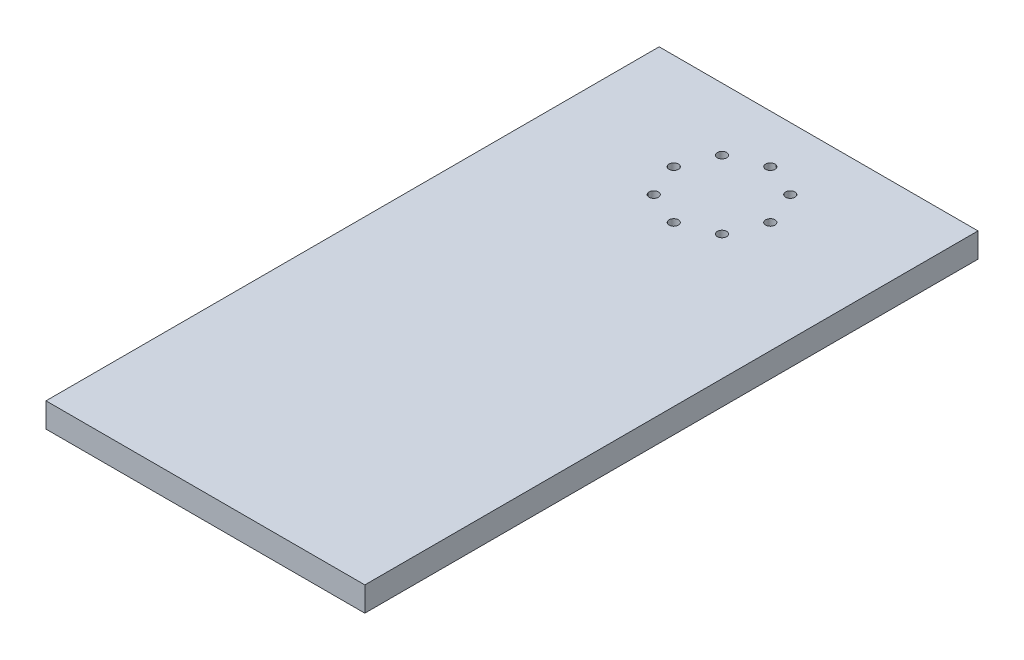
ISO-10303-21;
HEADER;
FILE_DESCRIPTION(('STEP AP214'),'2;1');
FILE_NAME('part.step','',(''),(''),'','','');
FILE_SCHEMA(('AUTOMOTIVE_DESIGN { 1 0 10303 214 1 1 1 1 }'));
ENDSEC;
DATA;
#1=APPLICATION_CONTEXT('core data for automotive mechanical design processes');
#2=APPLICATION_PROTOCOL_DEFINITION('international standard','automotive_design',2000,#1);
#3=PRODUCT_CONTEXT('',#1,'mechanical');
#4=PRODUCT('Part','Part','',(#3));
#5=PRODUCT_RELATED_PRODUCT_CATEGORY('part','',(#4));
#6=PRODUCT_DEFINITION_FORMATION('','',#4);
#7=PRODUCT_DEFINITION_CONTEXT('part definition',#1,'design');
#8=PRODUCT_DEFINITION('design','',#6,#7);
#9=PRODUCT_DEFINITION_SHAPE('','',#8);
#10=(LENGTH_UNIT() NAMED_UNIT(*) SI_UNIT(.MILLI.,.METRE.));
#11=(NAMED_UNIT(*) PLANE_ANGLE_UNIT() SI_UNIT($,.RADIAN.));
#12=(NAMED_UNIT(*) SI_UNIT($,.STERADIAN.) SOLID_ANGLE_UNIT());
#13=UNCERTAINTY_MEASURE_WITH_UNIT(LENGTH_MEASURE(1.E-05),#10,'distance_accuracy_value','');
#14=(GEOMETRIC_REPRESENTATION_CONTEXT(3) GLOBAL_UNCERTAINTY_ASSIGNED_CONTEXT((#13)) GLOBAL_UNIT_ASSIGNED_CONTEXT((#10,
#11,#12)) REPRESENTATION_CONTEXT('',''));
#15=CARTESIAN_POINT('',(0.,0.,0.));
#16=DIRECTION('',(0.,0.,1.));
#17=DIRECTION('',(1.,0.,0.));
#18=AXIS2_PLACEMENT_3D('',#15,#16,#17);
#19=CARTESIAN_POINT('',(82.55,-12.7,267.5));
#20=DIRECTION('',(1.,0.,0.));
#21=DIRECTION('',(0.,0.,-1.));
#22=AXIS2_PLACEMENT_3D('',#19,#20,#21);
#23=PLANE('',#22);
#24=DIRECTION('',(0.,0.,-1.));
#25=VECTOR('',#24,1.);
#26=CARTESIAN_POINT('',(82.55,0.,267.5));
#27=LINE('',#26,#25);
#28=CARTESIAN_POINT('',(82.55,0.,267.5));
#29=VERTEX_POINT('',#28);
#30=CARTESIAN_POINT('',(82.55,0.,-50.));
#31=VERTEX_POINT('',#30);
#32=EDGE_CURVE('E100',#29,#31,#27,.T.);
#33=ORIENTED_EDGE('',*,*,#32,.F.);
#34=DIRECTION('',(0.,1.,0.));
#35=VECTOR('',#34,1.);
#36=CARTESIAN_POINT('',(82.55,-12.7,267.5));
#37=LINE('',#36,#35);
#38=CARTESIAN_POINT('',(82.55,-12.7,267.5));
#39=VERTEX_POINT('',#38);
#40=EDGE_CURVE('E11',#39,#29,#37,.T.);
#41=ORIENTED_EDGE('',*,*,#40,.F.);
#42=DIRECTION('',(0.,0.,-1.));
#43=VECTOR('',#42,1.);
#44=CARTESIAN_POINT('',(82.55,-12.7,267.5));
#45=LINE('',#44,#43);
#46=CARTESIAN_POINT('',(82.55,-12.7,-50.));
#47=VERTEX_POINT('',#46);
#48=EDGE_CURVE('E93',#39,#47,#45,.T.);
#49=ORIENTED_EDGE('',*,*,#48,.T.);
#50=DIRECTION('',(0.,1.,0.));
#51=VECTOR('',#50,1.);
#52=CARTESIAN_POINT('',(82.55,-12.7,-50.));
#53=LINE('',#52,#51);
#54=EDGE_CURVE('E38',#47,#31,#53,.T.);
#55=ORIENTED_EDGE('',*,*,#54,.T.);
#56=EDGE_LOOP('',(#33,#41,#49,#55));
#57=FACE_BOUND('',#56,.T.);
#58=ADVANCED_FACE('F35',(#57),#23,.T.);
#59=CARTESIAN_POINT('',(-82.55,-12.7,267.5));
#60=DIRECTION('',(0.,0.,1.));
#61=DIRECTION('',(1.,0.,0.));
#62=AXIS2_PLACEMENT_3D('',#59,#60,#61);
#63=PLANE('',#62);
#64=DIRECTION('',(1.,0.,0.));
#65=VECTOR('',#64,1.);
#66=CARTESIAN_POINT('',(-82.55,0.,267.5));
#67=LINE('',#66,#65);
#68=CARTESIAN_POINT('',(-82.55,0.,267.5));
#69=VERTEX_POINT('',#68);
#70=EDGE_CURVE('E95',#69,#29,#67,.T.);
#71=ORIENTED_EDGE('',*,*,#70,.F.);
#72=DIRECTION('',(0.,1.,0.));
#73=VECTOR('',#72,1.);
#74=CARTESIAN_POINT('',(-82.55,-12.7,267.5));
#75=LINE('',#74,#73);
#76=CARTESIAN_POINT('',(-82.55,-12.7,267.5));
#77=VERTEX_POINT('',#76);
#78=EDGE_CURVE('E44',#77,#69,#75,.T.);
#79=ORIENTED_EDGE('',*,*,#78,.F.);
#80=DIRECTION('',(1.,0.,0.));
#81=VECTOR('',#80,1.);
#82=CARTESIAN_POINT('',(-82.55,-12.7,267.5));
#83=LINE('',#82,#81);
#84=EDGE_CURVE('E90',#77,#39,#83,.T.);
#85=ORIENTED_EDGE('',*,*,#84,.T.);
#86=ORIENTED_EDGE('',*,*,#40,.T.);
#87=EDGE_LOOP('',(#71,#79,#85,#86));
#88=FACE_BOUND('',#87,.T.);
#89=ADVANCED_FACE('F111',(#88),#63,.T.);
#90=CARTESIAN_POINT('',(-82.55,-12.7,267.5));
#91=DIRECTION('',(-1.,0.,0.));
#92=DIRECTION('',(0.,0.,1.));
#93=AXIS2_PLACEMENT_3D('',#90,#91,#92);
#94=PLANE('',#93);
#95=DIRECTION('',(0.,0.,1.));
#96=VECTOR('',#95,1.);
#97=CARTESIAN_POINT('',(-82.55,0.,267.5));
#98=LINE('',#97,#96);
#99=CARTESIAN_POINT('',(-82.55,0.,-50.));
#100=VERTEX_POINT('',#99);
#101=EDGE_CURVE('E85',#100,#69,#98,.T.);
#102=ORIENTED_EDGE('',*,*,#101,.F.);
#103=DIRECTION('',(0.,1.,0.));
#104=VECTOR('',#103,1.);
#105=CARTESIAN_POINT('',(-82.55,-12.7,-50.));
#106=LINE('',#105,#104);
#107=CARTESIAN_POINT('',(-82.55,-12.7,-50.));
#108=VERTEX_POINT('',#107);
#109=EDGE_CURVE('E80',#108,#100,#106,.T.);
#110=ORIENTED_EDGE('',*,*,#109,.F.);
#111=DIRECTION('',(0.,0.,1.));
#112=VECTOR('',#111,1.);
#113=CARTESIAN_POINT('',(-82.55,-12.7,267.5));
#114=LINE('',#113,#112);
#115=EDGE_CURVE('E83',#108,#77,#114,.T.);
#116=ORIENTED_EDGE('',*,*,#115,.T.);
#117=ORIENTED_EDGE('',*,*,#78,.T.);
#118=EDGE_LOOP('',(#102,#110,#116,#117));
#119=FACE_BOUND('',#118,.T.);
#120=ADVANCED_FACE('F82',(#119),#94,.T.);
#121=CARTESIAN_POINT('',(-82.55,-12.7,-50.));
#122=DIRECTION('',(0.,0.,-1.));
#123=DIRECTION('',(-1.,0.,0.));
#124=AXIS2_PLACEMENT_3D('',#121,#122,#123);
#125=PLANE('',#124);
#126=DIRECTION('',(-1.,0.,0.));
#127=VECTOR('',#126,1.);
#128=CARTESIAN_POINT('',(-82.55,0.,-50.));
#129=LINE('',#128,#127);
#130=EDGE_CURVE('E103',#31,#100,#129,.T.);
#131=ORIENTED_EDGE('',*,*,#130,.F.);
#132=ORIENTED_EDGE('',*,*,#54,.F.);
#133=DIRECTION('',(-1.,0.,0.));
#134=VECTOR('',#133,1.);
#135=CARTESIAN_POINT('',(-82.55,-12.7,-50.));
#136=LINE('',#135,#134);
#137=EDGE_CURVE('E89',#47,#108,#136,.T.);
#138=ORIENTED_EDGE('',*,*,#137,.T.);
#139=ORIENTED_EDGE('',*,*,#109,.T.);
#140=EDGE_LOOP('',(#131,#132,#138,#139));
#141=FACE_BOUND('',#140,.T.);
#142=ADVANCED_FACE('F92',(#141),#125,.T.);
#143=CARTESIAN_POINT('',(0.,-12.7,0.));
#144=DIRECTION('',(0.,-1.,0.));
#145=DIRECTION('',(0.,0.,-1.));
#146=AXIS2_PLACEMENT_3D('',#143,#144,#145);
#147=PLANE('',#146);
#148=CARTESIAN_POINT('',(0.,-12.7,25.));
#149=DIRECTION('',(0.,1.,0.));
#150=DIRECTION('',(0.707106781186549,0.,0.707106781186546));
#151=AXIS2_PLACEMENT_3D('',#148,#149,#150);
#152=CIRCLE('',#151,2.415);
#153=CARTESIAN_POINT('',(1.7076628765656,-12.7,26.7076628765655));
#154=VERTEX_POINT('',#153);
#155=EDGE_CURVE('E168',#154,#154,#152,.T.);
#156=ORIENTED_EDGE('',*,*,#155,.T.);
#157=EDGE_LOOP('',(#156));
#158=FACE_BOUND('',#157,.T.);
#159=CARTESIAN_POINT('',(17.6776695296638,-12.7,17.6776695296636));
#160=DIRECTION('',(0.,1.,0.));
#161=DIRECTION('',(1.,0.,0.));
#162=AXIS2_PLACEMENT_3D('',#159,#160,#161);
#163=CIRCLE('',#162,2.415);
#164=CARTESIAN_POINT('',(20.0926695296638,-12.7,17.6776695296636));
#165=VERTEX_POINT('',#164);
#166=EDGE_CURVE('E172',#165,#165,#163,.T.);
#167=ORIENTED_EDGE('',*,*,#166,.T.);
#168=EDGE_LOOP('',(#167));
#169=FACE_BOUND('',#168,.T.);
#170=CARTESIAN_POINT('',(25.,-12.7,-1.78676518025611E-13));
#171=DIRECTION('',(0.,1.,0.));
#172=DIRECTION('',(0.707106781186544,0.,-0.707106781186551));
#173=AXIS2_PLACEMENT_3D('',#170,#171,#172);
#174=CIRCLE('',#173,2.415);
#175=CARTESIAN_POINT('',(26.7076628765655,-12.7,-1.7076628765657));
#176=VERTEX_POINT('',#175);
#177=EDGE_CURVE('E182',#176,#176,#174,.T.);
#178=ORIENTED_EDGE('',*,*,#177,.T.);
#179=EDGE_LOOP('',(#178));
#180=FACE_BOUND('',#179,.T.);
#181=CARTESIAN_POINT('',(17.6776695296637,-12.7,-17.6776695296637));
#182=DIRECTION('',(0.,1.,0.));
#183=DIRECTION('',(0.,0.,-1.));
#184=AXIS2_PLACEMENT_3D('',#181,#182,#183);
#185=CIRCLE('',#184,2.415);
#186=CARTESIAN_POINT('',(17.6776695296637,-12.7,-20.0926695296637));
#187=VERTEX_POINT('',#186);
#188=EDGE_CURVE('E188',#187,#187,#185,.T.);
#189=ORIENTED_EDGE('',*,*,#188,.T.);
#190=EDGE_LOOP('',(#189));
#191=FACE_BOUND('',#190,.T.);
#192=CARTESIAN_POINT('',(-2.63677968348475E-13,-12.7,-25.));
#193=DIRECTION('',(0.,1.,0.));
#194=DIRECTION('',(-0.707106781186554,0.,-0.707106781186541));
#195=AXIS2_PLACEMENT_3D('',#192,#193,#194);
#196=CIRCLE('',#195,2.415);
#197=CARTESIAN_POINT('',(-1.70766287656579,-12.7,-26.7076628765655));
#198=VERTEX_POINT('',#197);
#199=EDGE_CURVE('E194',#198,#198,#196,.T.);
#200=ORIENTED_EDGE('',*,*,#199,.T.);
#201=EDGE_LOOP('',(#200));
#202=FACE_BOUND('',#201,.T.);
#203=CARTESIAN_POINT('',(-17.6776695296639,-12.7,-17.6776695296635));
#204=DIRECTION('',(0.,1.,0.));
#205=DIRECTION('',(-1.,0.,0.));
#206=AXIS2_PLACEMENT_3D('',#203,#204,#205);
#207=CIRCLE('',#206,2.415);
#208=CARTESIAN_POINT('',(-20.0926695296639,-12.7,-17.6776695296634));
#209=VERTEX_POINT('',#208);
#210=EDGE_CURVE('E200',#209,#209,#207,.T.);
#211=ORIENTED_EDGE('',*,*,#210,.T.);
#212=EDGE_LOOP('',(#211));
#213=FACE_BOUND('',#212,.T.);
#214=CARTESIAN_POINT('',(-25.,-12.7,3.50414142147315E-13));
#215=DIRECTION('',(0.,1.,0.));
#216=DIRECTION('',(-0.707106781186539,0.,0.707106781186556));
#217=AXIS2_PLACEMENT_3D('',#214,#215,#216);
#218=CIRCLE('',#217,2.415);
#219=CARTESIAN_POINT('',(-26.7076628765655,-12.7,1.70766287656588));
#220=VERTEX_POINT('',#219);
#221=EDGE_CURVE('E206',#220,#220,#218,.T.);
#222=ORIENTED_EDGE('',*,*,#221,.T.);
#223=EDGE_LOOP('',(#222));
#224=FACE_BOUND('',#223,.T.);
#225=CARTESIAN_POINT('',(-17.6776695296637,-12.7,17.6776695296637));
#226=DIRECTION('',(0.,1.,0.));
#227=DIRECTION('',(0.,0.,1.));
#228=AXIS2_PLACEMENT_3D('',#225,#226,#227);
#229=CIRCLE('',#228,2.415);
#230=CARTESIAN_POINT('',(-17.6776695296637,-12.7,20.0926695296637));
#231=VERTEX_POINT('',#230);
#232=EDGE_CURVE('E104',#231,#231,#229,.T.);
#233=ORIENTED_EDGE('',*,*,#232,.T.);
#234=EDGE_LOOP('',(#233));
#235=FACE_BOUND('',#234,.T.);
#236=ORIENTED_EDGE('',*,*,#48,.F.);
#237=ORIENTED_EDGE('',*,*,#84,.F.);
#238=ORIENTED_EDGE('',*,*,#115,.F.);
#239=ORIENTED_EDGE('',*,*,#137,.F.);
#240=EDGE_LOOP('',(#236,#237,#238,#239));
#241=FACE_BOUND('',#240,.T.);
#242=ADVANCED_FACE('F88',(#158,#169,#180,#191,#202,#213,#224,#235,#241),#147,.T.);
#243=CARTESIAN_POINT('',(0.,0.,0.));
#244=DIRECTION('',(0.,-1.,0.));
#245=DIRECTION('',(0.,0.,-1.));
#246=AXIS2_PLACEMENT_3D('',#243,#244,#245);
#247=PLANE('',#246);
#248=CARTESIAN_POINT('',(0.,0.,25.));
#249=DIRECTION('',(0.,1.,0.));
#250=DIRECTION('',(0.707106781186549,0.,0.707106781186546));
#251=AXIS2_PLACEMENT_3D('',#248,#249,#250);
#252=CIRCLE('',#251,2.415);
#253=CARTESIAN_POINT('',(1.7076628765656,0.,26.7076628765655));
#254=VERTEX_POINT('',#253);
#255=EDGE_CURVE('E171',#254,#254,#252,.T.);
#256=ORIENTED_EDGE('',*,*,#255,.F.);
#257=EDGE_LOOP('',(#256));
#258=FACE_BOUND('',#257,.T.);
#259=CARTESIAN_POINT('',(17.6776695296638,0.,17.6776695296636));
#260=DIRECTION('',(0.,1.,0.));
#261=DIRECTION('',(1.,0.,0.));
#262=AXIS2_PLACEMENT_3D('',#259,#260,#261);
#263=CIRCLE('',#262,2.415);
#264=CARTESIAN_POINT('',(20.0926695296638,0.,17.6776695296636));
#265=VERTEX_POINT('',#264);
#266=EDGE_CURVE('E177',#265,#265,#263,.T.);
#267=ORIENTED_EDGE('',*,*,#266,.F.);
#268=EDGE_LOOP('',(#267));
#269=FACE_BOUND('',#268,.T.);
#270=CARTESIAN_POINT('',(25.,0.,-1.78676518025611E-13));
#271=DIRECTION('',(0.,1.,0.));
#272=DIRECTION('',(0.707106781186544,0.,-0.707106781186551));
#273=AXIS2_PLACEMENT_3D('',#270,#271,#272);
#274=CIRCLE('',#273,2.415);
#275=CARTESIAN_POINT('',(26.7076628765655,0.,-1.7076628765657));
#276=VERTEX_POINT('',#275);
#277=EDGE_CURVE('E185',#276,#276,#274,.T.);
#278=ORIENTED_EDGE('',*,*,#277,.F.);
#279=EDGE_LOOP('',(#278));
#280=FACE_BOUND('',#279,.T.);
#281=CARTESIAN_POINT('',(17.6776695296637,0.,-17.6776695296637));
#282=DIRECTION('',(0.,1.,0.));
#283=DIRECTION('',(0.,0.,-1.));
#284=AXIS2_PLACEMENT_3D('',#281,#282,#283);
#285=CIRCLE('',#284,2.415);
#286=CARTESIAN_POINT('',(17.6776695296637,0.,-20.0926695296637));
#287=VERTEX_POINT('',#286);
#288=EDGE_CURVE('E191',#287,#287,#285,.T.);
#289=ORIENTED_EDGE('',*,*,#288,.F.);
#290=EDGE_LOOP('',(#289));
#291=FACE_BOUND('',#290,.T.);
#292=CARTESIAN_POINT('',(-2.63677968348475E-13,0.,-25.));
#293=DIRECTION('',(0.,1.,0.));
#294=DIRECTION('',(-0.707106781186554,0.,-0.707106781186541));
#295=AXIS2_PLACEMENT_3D('',#292,#293,#294);
#296=CIRCLE('',#295,2.415);
#297=CARTESIAN_POINT('',(-1.70766287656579,0.,-26.7076628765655));
#298=VERTEX_POINT('',#297);
#299=EDGE_CURVE('E197',#298,#298,#296,.T.);
#300=ORIENTED_EDGE('',*,*,#299,.F.);
#301=EDGE_LOOP('',(#300));
#302=FACE_BOUND('',#301,.T.);
#303=CARTESIAN_POINT('',(-17.6776695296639,0.,-17.6776695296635));
#304=DIRECTION('',(0.,1.,0.));
#305=DIRECTION('',(-1.,0.,0.));
#306=AXIS2_PLACEMENT_3D('',#303,#304,#305);
#307=CIRCLE('',#306,2.415);
#308=CARTESIAN_POINT('',(-20.0926695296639,0.,-17.6776695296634));
#309=VERTEX_POINT('',#308);
#310=EDGE_CURVE('E203',#309,#309,#307,.T.);
#311=ORIENTED_EDGE('',*,*,#310,.F.);
#312=EDGE_LOOP('',(#311));
#313=FACE_BOUND('',#312,.T.);
#314=CARTESIAN_POINT('',(-25.,0.,3.50414142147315E-13));
#315=DIRECTION('',(0.,1.,0.));
#316=DIRECTION('',(-0.707106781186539,0.,0.707106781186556));
#317=AXIS2_PLACEMENT_3D('',#314,#315,#316);
#318=CIRCLE('',#317,2.415);
#319=CARTESIAN_POINT('',(-26.7076628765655,0.,1.70766287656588));
#320=VERTEX_POINT('',#319);
#321=EDGE_CURVE('E209',#320,#320,#318,.T.);
#322=ORIENTED_EDGE('',*,*,#321,.F.);
#323=EDGE_LOOP('',(#322));
#324=FACE_BOUND('',#323,.T.);
#325=CARTESIAN_POINT('',(-17.6776695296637,0.,17.6776695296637));
#326=DIRECTION('',(0.,1.,0.));
#327=DIRECTION('',(0.,0.,1.));
#328=AXIS2_PLACEMENT_3D('',#325,#326,#327);
#329=CIRCLE('',#328,2.415);
#330=CARTESIAN_POINT('',(-17.6776695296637,0.,20.0926695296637));
#331=VERTEX_POINT('',#330);
#332=EDGE_CURVE('E174',#331,#331,#329,.T.);
#333=ORIENTED_EDGE('',*,*,#332,.F.);
#334=EDGE_LOOP('',(#333));
#335=FACE_BOUND('',#334,.T.);
#336=ORIENTED_EDGE('',*,*,#32,.T.);
#337=ORIENTED_EDGE('',*,*,#130,.T.);
#338=ORIENTED_EDGE('',*,*,#101,.T.);
#339=ORIENTED_EDGE('',*,*,#70,.T.);
#340=EDGE_LOOP('',(#336,#337,#338,#339));
#341=FACE_BOUND('',#340,.T.);
#342=ADVANCED_FACE('F110',(#258,#269,#280,#291,#302,#313,#324,#335,#341),#247,.F.);
#343=CARTESIAN_POINT('',(-17.6776695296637,-12.7,17.6776695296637));
#344=DIRECTION('',(0.,1.,0.));
#345=DIRECTION('',(0.,0.,1.));
#346=AXIS2_PLACEMENT_3D('',#343,#344,#345);
#347=CYLINDRICAL_SURFACE('',#346,2.415);
#348=ORIENTED_EDGE('',*,*,#232,.F.);
#349=EDGE_LOOP('',(#348));
#350=FACE_BOUND('',#349,.T.);
#351=ORIENTED_EDGE('',*,*,#332,.T.);
#352=EDGE_LOOP('',(#351));
#353=FACE_BOUND('',#352,.T.);
#354=ADVANCED_FACE('F129',(#350,#353),#347,.F.);
#355=CARTESIAN_POINT('',(-25.,-12.7,3.50414142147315E-13));
#356=DIRECTION('',(0.,1.,0.));
#357=DIRECTION('',(0.,0.,1.));
#358=AXIS2_PLACEMENT_3D('',#355,#356,#357);
#359=CYLINDRICAL_SURFACE('',#358,2.415);
#360=ORIENTED_EDGE('',*,*,#221,.F.);
#361=EDGE_LOOP('',(#360));
#362=FACE_BOUND('',#361,.T.);
#363=ORIENTED_EDGE('',*,*,#321,.T.);
#364=EDGE_LOOP('',(#363));
#365=FACE_BOUND('',#364,.T.);
#366=ADVANCED_FACE('F136',(#362,#365),#359,.F.);
#367=CARTESIAN_POINT('',(-17.6776695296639,-12.7,-17.6776695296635));
#368=DIRECTION('',(0.,1.,0.));
#369=DIRECTION('',(0.,0.,1.));
#370=AXIS2_PLACEMENT_3D('',#367,#368,#369);
#371=CYLINDRICAL_SURFACE('',#370,2.415);
#372=ORIENTED_EDGE('',*,*,#210,.F.);
#373=EDGE_LOOP('',(#372));
#374=FACE_BOUND('',#373,.T.);
#375=ORIENTED_EDGE('',*,*,#310,.T.);
#376=EDGE_LOOP('',(#375));
#377=FACE_BOUND('',#376,.T.);
#378=ADVANCED_FACE('F140',(#374,#377),#371,.F.);
#379=CARTESIAN_POINT('',(-2.63677968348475E-13,-12.7,-25.));
#380=DIRECTION('',(0.,1.,0.));
#381=DIRECTION('',(0.,0.,1.));
#382=AXIS2_PLACEMENT_3D('',#379,#380,#381);
#383=CYLINDRICAL_SURFACE('',#382,2.415);
#384=ORIENTED_EDGE('',*,*,#199,.F.);
#385=EDGE_LOOP('',(#384));
#386=FACE_BOUND('',#385,.T.);
#387=ORIENTED_EDGE('',*,*,#299,.T.);
#388=EDGE_LOOP('',(#387));
#389=FACE_BOUND('',#388,.T.);
#390=ADVANCED_FACE('F144',(#386,#389),#383,.F.);
#391=CARTESIAN_POINT('',(17.6776695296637,-12.7,-17.6776695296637));
#392=DIRECTION('',(0.,1.,0.));
#393=DIRECTION('',(0.,0.,1.));
#394=AXIS2_PLACEMENT_3D('',#391,#392,#393);
#395=CYLINDRICAL_SURFACE('',#394,2.415);
#396=ORIENTED_EDGE('',*,*,#188,.F.);
#397=EDGE_LOOP('',(#396));
#398=FACE_BOUND('',#397,.T.);
#399=ORIENTED_EDGE('',*,*,#288,.T.);
#400=EDGE_LOOP('',(#399));
#401=FACE_BOUND('',#400,.T.);
#402=ADVANCED_FACE('F148',(#398,#401),#395,.F.);
#403=CARTESIAN_POINT('',(25.,-12.7,-1.78676518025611E-13));
#404=DIRECTION('',(0.,1.,0.));
#405=DIRECTION('',(0.,0.,1.));
#406=AXIS2_PLACEMENT_3D('',#403,#404,#405);
#407=CYLINDRICAL_SURFACE('',#406,2.415);
#408=ORIENTED_EDGE('',*,*,#177,.F.);
#409=EDGE_LOOP('',(#408));
#410=FACE_BOUND('',#409,.T.);
#411=ORIENTED_EDGE('',*,*,#277,.T.);
#412=EDGE_LOOP('',(#411));
#413=FACE_BOUND('',#412,.T.);
#414=ADVANCED_FACE('F152',(#410,#413),#407,.F.);
#415=CARTESIAN_POINT('',(17.6776695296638,-12.7,17.6776695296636));
#416=DIRECTION('',(0.,1.,0.));
#417=DIRECTION('',(0.,0.,1.));
#418=AXIS2_PLACEMENT_3D('',#415,#416,#417);
#419=CYLINDRICAL_SURFACE('',#418,2.415);
#420=ORIENTED_EDGE('',*,*,#166,.F.);
#421=EDGE_LOOP('',(#420));
#422=FACE_BOUND('',#421,.T.);
#423=ORIENTED_EDGE('',*,*,#266,.T.);
#424=EDGE_LOOP('',(#423));
#425=FACE_BOUND('',#424,.T.);
#426=ADVANCED_FACE('F156',(#422,#425),#419,.F.);
#427=CARTESIAN_POINT('',(0.,-12.7,25.));
#428=DIRECTION('',(0.,1.,0.));
#429=DIRECTION('',(0.,0.,1.));
#430=AXIS2_PLACEMENT_3D('',#427,#428,#429);
#431=CYLINDRICAL_SURFACE('',#430,2.415);
#432=ORIENTED_EDGE('',*,*,#155,.F.);
#433=EDGE_LOOP('',(#432));
#434=FACE_BOUND('',#433,.T.);
#435=ORIENTED_EDGE('',*,*,#255,.T.);
#436=EDGE_LOOP('',(#435));
#437=FACE_BOUND('',#436,.T.);
#438=ADVANCED_FACE('F160',(#434,#437),#431,.F.);
#439=CLOSED_SHELL('',(#58,#89,#120,#142,#242,#342,#354,#366,#378,#390,#402,#414,#426,#438));
#440=MANIFOLD_SOLID_BREP('B2',#439);
#441=ADVANCED_BREP_SHAPE_REPRESENTATION('',(#18,#440),#14);
#442=SHAPE_DEFINITION_REPRESENTATION(#9,#441);
ENDSEC;
END-ISO-10303-21;
